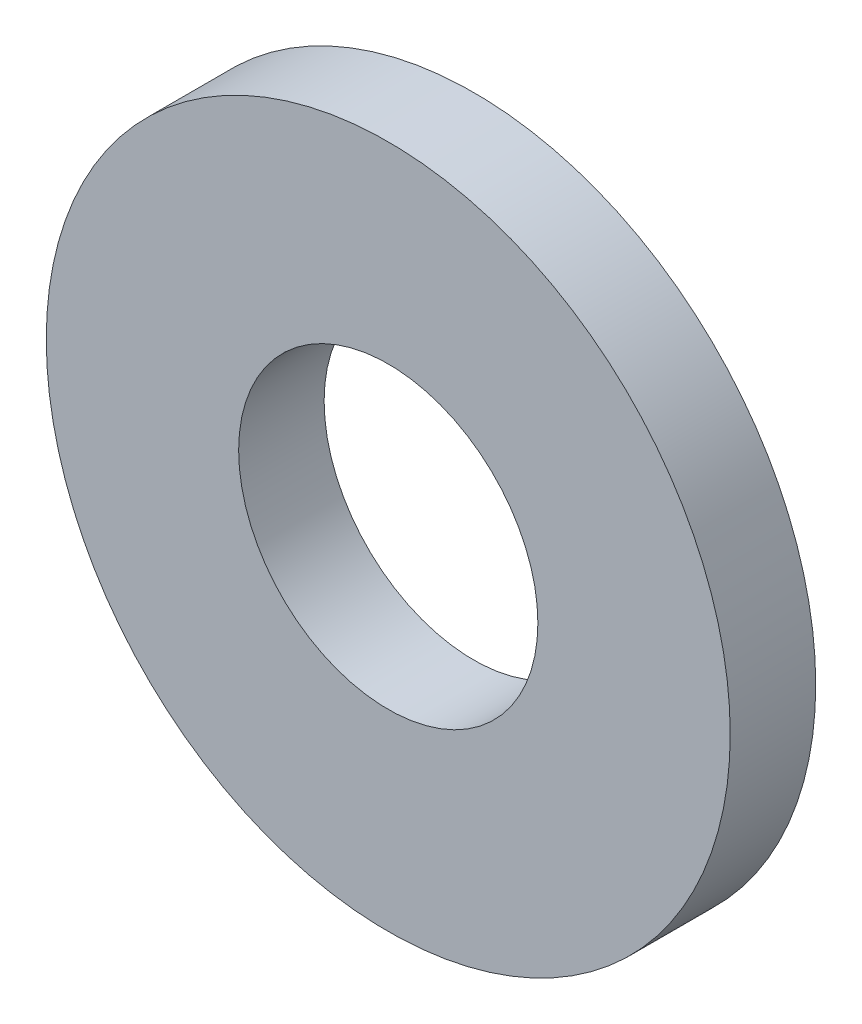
from build123d import *

# Parameters (mm, degrees)
ESQUISSE1_R        = 4
ESQUISSE1_R_2      = 1.75
BOSS_EXTRU_1_DEPTH = 1


with BuildPart() as part:
    # Esquisse1 → Boss.-Extru.1 (new body)
    with BuildSketch(Plane.XY):
        Circle(ESQUISSE1_R)
        Circle(ESQUISSE1_R_2, mode=Mode.SUBTRACT)
    extrude(amount=BOSS_EXTRU_1_DEPTH)


solid = part.part
